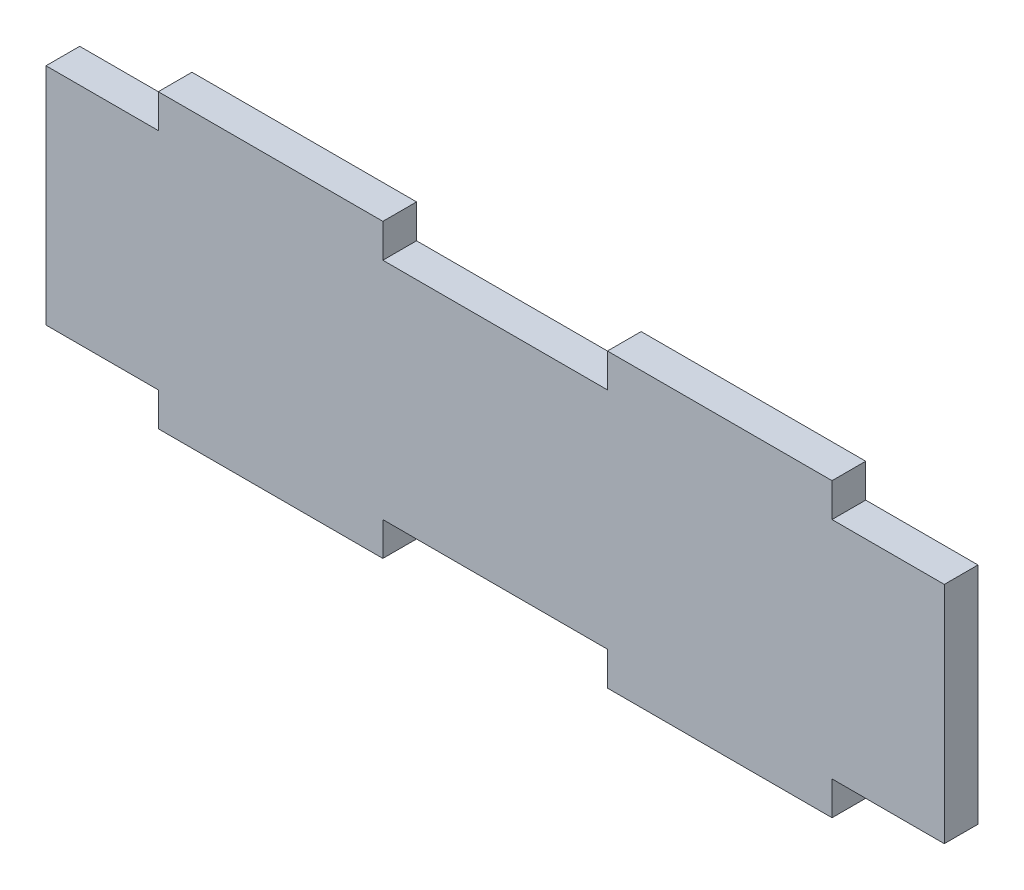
from build123d import *

# Parameters (mm, degrees)
SKETCH2_W           = 80
SKETCH2_H           = 20
SKETCH2_W_2         = 20
SKETCH2_H_2         = 3
BOSS_EXTRUDE1_DEPTH = 3


with BuildPart() as part:
    # Sketch2 → Boss-Extrude1 (new body)
    with BuildSketch(Plane.XY):
        with Locations((40, 10)):
            Rectangle(SKETCH2_W, SKETCH2_H)
        with Locations((20, 21.5)):
            Rectangle(SKETCH2_W_2, SKETCH2_H_2)
        with Locations((20, -1.5)):
            Rectangle(SKETCH2_W_2, SKETCH2_H_2)
        with Locations((60, 21.5)):
            Rectangle(SKETCH2_W_2, SKETCH2_H_2)
        with Locations((60, -1.5)):
            Rectangle(SKETCH2_W_2, SKETCH2_H_2)
    extrude(amount=BOSS_EXTRUDE1_DEPTH)


solid = part.part
